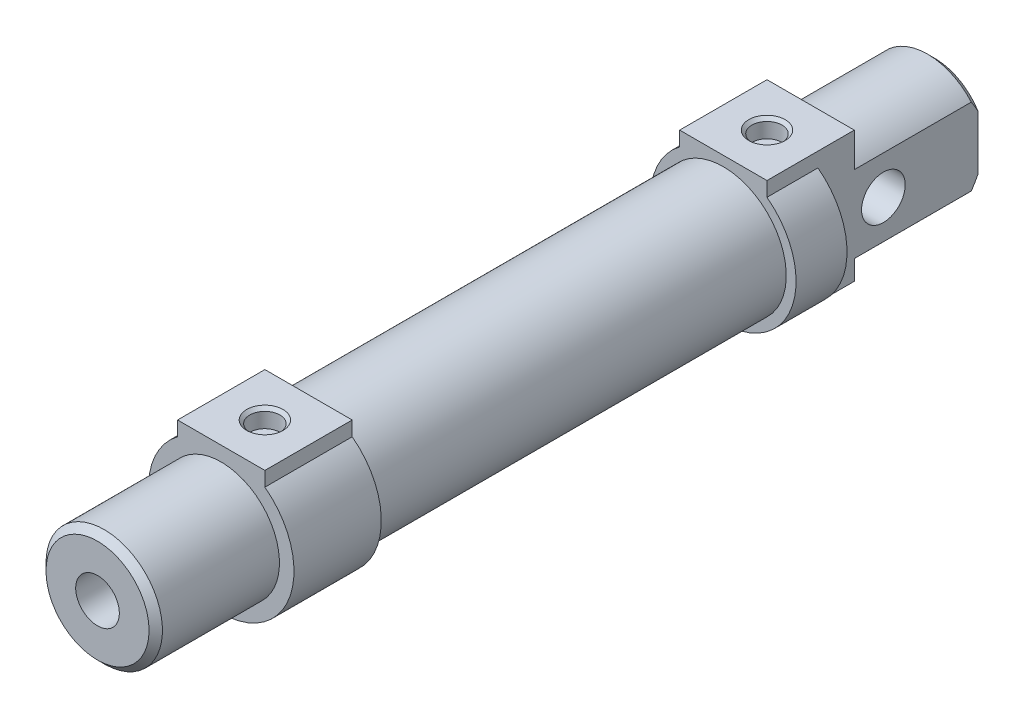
ISO-10303-21;
HEADER;
FILE_DESCRIPTION(('STEP AP214'),'2;1');
FILE_NAME('part.step','',(''),(''),'','','');
FILE_SCHEMA(('AUTOMOTIVE_DESIGN { 1 0 10303 214 1 1 1 1 }'));
ENDSEC;
DATA;
#1=APPLICATION_CONTEXT('core data for automotive mechanical design processes');
#2=APPLICATION_PROTOCOL_DEFINITION('international standard','automotive_design',2000,#1);
#3=PRODUCT_CONTEXT('',#1,'mechanical');
#4=PRODUCT('Part','Part','',(#3));
#5=PRODUCT_RELATED_PRODUCT_CATEGORY('part','',(#4));
#6=PRODUCT_DEFINITION_FORMATION('','',#4);
#7=PRODUCT_DEFINITION_CONTEXT('part definition',#1,'design');
#8=PRODUCT_DEFINITION('design','',#6,#7);
#9=PRODUCT_DEFINITION_SHAPE('','',#8);
#10=(LENGTH_UNIT() NAMED_UNIT(*) SI_UNIT(.MILLI.,.METRE.));
#11=(NAMED_UNIT(*) PLANE_ANGLE_UNIT() SI_UNIT($,.RADIAN.));
#12=(NAMED_UNIT(*) SI_UNIT($,.STERADIAN.) SOLID_ANGLE_UNIT());
#13=UNCERTAINTY_MEASURE_WITH_UNIT(LENGTH_MEASURE(1.E-05),#10,'distance_accuracy_value','');
#14=(GEOMETRIC_REPRESENTATION_CONTEXT(3) GLOBAL_UNCERTAINTY_ASSIGNED_CONTEXT((#13)) GLOBAL_UNIT_ASSIGNED_CONTEXT((#10,
#11,#12)) REPRESENTATION_CONTEXT('',''));
#15=CARTESIAN_POINT('',(0.,0.,0.));
#16=DIRECTION('',(0.,0.,1.));
#17=DIRECTION('',(1.,0.,0.));
#18=AXIS2_PLACEMENT_3D('',#15,#16,#17);
#19=CARTESIAN_POINT('',(6.,20.,-99.));
#20=DIRECTION('',(1.,0.,0.));
#21=DIRECTION('',(0.,0.,-1.));
#22=AXIS2_PLACEMENT_3D('',#19,#20,#21);
#23=PLANE('',#22);
#24=DIRECTION('',(0.,0.,-1.));
#25=VECTOR('',#24,1.);
#26=CARTESIAN_POINT('',(6.,5.29150262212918,-98.));
#27=LINE('',#26,#25);
#28=CARTESIAN_POINT('',(6.,5.29150262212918,-81.));
#29=VERTEX_POINT('',#28);
#30=CARTESIAN_POINT('',(6.,5.29150262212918,-97.08));
#31=VERTEX_POINT('',#30);
#32=EDGE_CURVE('E216',#29,#31,#27,.T.);
#33=ORIENTED_EDGE('',*,*,#32,.F.);
#34=DIRECTION('',(0.,-1.,0.));
#35=VECTOR('',#34,1.);
#36=CARTESIAN_POINT('',(6.,10.,-81.));
#37=LINE('',#36,#35);
#38=CARTESIAN_POINT('',(6.,10.,-81.));
#39=VERTEX_POINT('',#38);
#40=EDGE_CURVE('E309',#39,#29,#37,.T.);
#41=ORIENTED_EDGE('',*,*,#40,.F.);
#42=DIRECTION('',(0.,0.,-1.));
#43=VECTOR('',#42,1.);
#44=CARTESIAN_POINT('',(6.,10.,-69.));
#45=LINE('',#44,#43);
#46=CARTESIAN_POINT('',(6.,10.,-69.));
#47=VERTEX_POINT('',#46);
#48=EDGE_CURVE('E159',#47,#39,#45,.T.);
#49=ORIENTED_EDGE('',*,*,#48,.F.);
#50=DIRECTION('',(0.,-1.,0.));
#51=VECTOR('',#50,1.);
#52=CARTESIAN_POINT('',(6.,10.,-69.));
#53=LINE('',#52,#51);
#54=CARTESIAN_POINT('',(6.,8.,-69.));
#55=VERTEX_POINT('',#54);
#56=EDGE_CURVE('E155',#47,#55,#53,.T.);
#57=ORIENTED_EDGE('',*,*,#56,.T.);
#58=DIRECTION('',(0.,0.,-1.));
#59=VECTOR('',#58,1.);
#60=CARTESIAN_POINT('',(6.,8.,-98.));
#61=LINE('',#60,#59);
#62=CARTESIAN_POINT('',(6.,8.,-76.));
#63=VERTEX_POINT('',#62);
#64=EDGE_CURVE('E174',#63,#55,#61,.F.);
#65=ORIENTED_EDGE('',*,*,#64,.F.);
#66=DIRECTION('',(0.,-1.,0.));
#67=VECTOR('',#66,1.);
#68=CARTESIAN_POINT('',(6.,20.,-76.));
#69=LINE('',#68,#67);
#70=CARTESIAN_POINT('',(6.,-8.,-76.));
#71=VERTEX_POINT('',#70);
#72=EDGE_CURVE('E205',#63,#71,#69,.T.);
#73=ORIENTED_EDGE('',*,*,#72,.T.);
#74=DIRECTION('',(0.,0.,-1.));
#75=VECTOR('',#74,1.);
#76=CARTESIAN_POINT('',(6.,-8.,-98.));
#77=LINE('',#76,#75);
#78=CARTESIAN_POINT('',(6.,-8.,-81.));
#79=VERTEX_POINT('',#78);
#80=EDGE_CURVE('E241',#79,#71,#77,.F.);
#81=ORIENTED_EDGE('',*,*,#80,.F.);
#82=CARTESIAN_POINT('',(6.,-5.29150262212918,-81.));
#83=VERTEX_POINT('',#82);
#84=EDGE_CURVE('E490',#83,#79,#37,.T.);
#85=ORIENTED_EDGE('',*,*,#84,.F.);
#86=DIRECTION('',(0.,0.,-1.));
#87=VECTOR('',#86,1.);
#88=CARTESIAN_POINT('',(6.,-5.29150262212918,-98.));
#89=LINE('',#88,#87);
#90=CARTESIAN_POINT('',(6.,-5.29150262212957,-97.0799999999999));
#91=VERTEX_POINT('',#90);
#92=EDGE_CURVE('E492',#91,#83,#89,.F.);
#93=ORIENTED_EDGE('',*,*,#92,.F.);
#94=CARTESIAN_POINT('',(6.,16.5627733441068,-87.4639430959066));
#95=CARTESIAN_POINT('',(6.,16.3020845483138,-87.7090401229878));
#96=CARTESIAN_POINT('',(6.,16.0410657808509,-87.9537864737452));
#97=CARTESIAN_POINT('',(6.,15.5182599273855,-88.4424601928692));
#98=CARTESIAN_POINT('',(6.,15.256472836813,-88.6863875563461));
#99=CARTESIAN_POINT('',(6.,14.4694280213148,-89.4171067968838));
#100=CARTESIAN_POINT('',(6.,13.9428574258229,-89.9024866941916));
#101=CARTESIAN_POINT('',(6.,12.8714104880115,-90.8805679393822));
#102=CARTESIAN_POINT('',(6.,12.3264119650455,-91.373135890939));
#103=CARTESIAN_POINT('',(6.,11.503894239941,-92.1060159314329));
#104=CARTESIAN_POINT('',(6.,11.2289703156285,-92.3492400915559));
#105=CARTESIAN_POINT('',(6.,10.6770360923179,-92.8333077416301));
#106=CARTESIAN_POINT('',(6.,10.4000258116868,-93.074151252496));
#107=CARTESIAN_POINT('',(6.,9.84363689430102,-93.5527682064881));
#108=CARTESIAN_POINT('',(6.,9.56425969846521,-93.7905433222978));
#109=CARTESIAN_POINT('',(6.,9.00240208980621,-94.2624231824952));
#110=CARTESIAN_POINT('',(6.,8.71992158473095,-94.4965278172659));
#111=CARTESIAN_POINT('',(6.,8.15054557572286,-94.9605095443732));
#112=CARTESIAN_POINT('',(6.,7.86364227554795,-95.1903770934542));
#113=CARTESIAN_POINT('',(6.,7.28501814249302,-95.6439427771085));
#114=CARTESIAN_POINT('',(6.,6.99329772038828,-95.8676414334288));
#115=CARTESIAN_POINT('',(6.,6.40681903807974,-96.304498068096));
#116=CARTESIAN_POINT('',(6.,6.11212531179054,-96.5177423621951));
#117=CARTESIAN_POINT('',(6.,5.51489178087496,-96.9333520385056));
#118=CARTESIAN_POINT('',(6.,5.21234880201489,-97.1357129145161));
#119=CARTESIAN_POINT('',(6.,4.75166528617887,-97.4272648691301));
#120=CARTESIAN_POINT('',(6.,4.59722348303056,-97.5223015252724));
#121=CARTESIAN_POINT('',(6.,4.28557909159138,-97.7077225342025));
#122=CARTESIAN_POINT('',(6.,4.12837677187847,-97.7981073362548));
#123=CARTESIAN_POINT('',(6.,3.81100877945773,-97.973222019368));
#124=CARTESIAN_POINT('',(6.,3.65084561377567,-98.057956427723));
#125=CARTESIAN_POINT('',(6.,3.32714418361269,-98.2206768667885));
#126=CARTESIAN_POINT('',(6.,3.16360670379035,-98.2986644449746));
#127=CARTESIAN_POINT('',(6.,2.90691036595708,-98.4134071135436));
#128=CARTESIAN_POINT('',(6.,2.81501423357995,-98.4529933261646));
#129=CARTESIAN_POINT('',(6.,2.6300832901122,-98.5294087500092));
#130=CARTESIAN_POINT('',(6.,2.53704846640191,-98.5662379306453));
#131=CARTESIAN_POINT('',(6.,2.25617639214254,-98.672172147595));
#132=CARTESIAN_POINT('',(6.,2.06658076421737,-98.7367196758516));
#133=CARTESIAN_POINT('',(6.,1.68405321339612,-98.8508003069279));
#134=CARTESIAN_POINT('',(6.,1.49114642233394,-98.9004167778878));
#135=CARTESIAN_POINT('',(6.,1.1017046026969,-98.9826586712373));
#136=CARTESIAN_POINT('',(6.,0.905169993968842,-99.0152860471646));
#137=CARTESIAN_POINT('',(6.,0.50716361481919,-99.0618881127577));
#138=CARTESIAN_POINT('',(6.,0.305661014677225,-99.0756048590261));
#139=CARTESIAN_POINT('',(6.,-0.0976866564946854,-99.0825930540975));
#140=CARTESIAN_POINT('',(6.,-0.299531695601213,-99.0758663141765));
#141=CARTESIAN_POINT('',(6.,-0.702225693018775,-99.0423930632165));
#142=CARTESIAN_POINT('',(6.,-0.903068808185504,-99.0155775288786));
#143=CARTESIAN_POINT('',(6.,-1.30143340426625,-98.9436097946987));
#144=CARTESIAN_POINT('',(6.,-1.49895387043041,-98.8984520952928));
#145=CARTESIAN_POINT('',(6.,-1.96003700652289,-98.7731525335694));
#146=CARTESIAN_POINT('',(6.,-2.2217542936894,-98.6862681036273));
#147=CARTESIAN_POINT('',(6.,-2.73645532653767,-98.4897478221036));
#148=CARTESIAN_POINT('',(6.,-2.98943402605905,-98.3800990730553));
#149=CARTESIAN_POINT('',(6.,-3.36410352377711,-98.2021385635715));
#150=CARTESIAN_POINT('',(6.,-3.48888235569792,-98.1401827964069));
#151=CARTESIAN_POINT('',(6.,-3.73648309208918,-98.0124653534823));
#152=CARTESIAN_POINT('',(6.,-3.85930497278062,-97.9467036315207));
#153=CARTESIAN_POINT('',(6.,-4.10307983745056,-97.8119224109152));
#154=CARTESIAN_POINT('',(6.,-4.22403351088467,-97.7429041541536));
#155=CARTESIAN_POINT('',(6.,-4.46425884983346,-97.6020216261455));
#156=CARTESIAN_POINT('',(6.,-4.58353060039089,-97.5301574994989));
#157=CARTESIAN_POINT('',(6.,-4.9940209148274,-97.2769716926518));
#158=CARTESIAN_POINT('',(6.,-5.28139093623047,-97.0893983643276));
#159=CARTESIAN_POINT('',(6.,-5.84884630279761,-96.7034949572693));
#160=CARTESIAN_POINT('',(6.,-6.1289294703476,-96.5051617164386));
#161=CARTESIAN_POINT('',(6.,-6.68355530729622,-96.1003583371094));
#162=CARTESIAN_POINT('',(6.,-6.95809222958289,-95.8938803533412));
#163=CARTESIAN_POINT('',(6.,-7.50249205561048,-95.4749382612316));
#164=CARTESIAN_POINT('',(6.,-7.77235546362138,-95.2624748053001));
#165=CARTESIAN_POINT('',(6.,-8.30946665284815,-94.8320074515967));
#166=CARTESIAN_POINT('',(6.,-8.57669884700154,-94.6139841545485));
#167=CARTESIAN_POINT('',(6.,-9.10811227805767,-94.174246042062));
#168=CARTESIAN_POINT('',(6.,-9.37229344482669,-93.95253114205));
#169=CARTESIAN_POINT('',(6.,-9.89799964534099,-93.5062751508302));
#170=CARTESIAN_POINT('',(6.,-10.1595260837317,-93.2817357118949));
#171=CARTESIAN_POINT('',(6.,-10.6805000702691,-92.8302562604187));
#172=CARTESIAN_POINT('',(6.,-10.9399475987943,-92.6033162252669));
#173=CARTESIAN_POINT('',(6.,-11.655065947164,-91.9729830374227));
#174=CARTESIAN_POINT('',(6.,-12.1089016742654,-91.5675084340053));
#175=CARTESIAN_POINT('',(6.,-13.0126144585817,-90.752043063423));
#176=CARTESIAN_POINT('',(6.,-13.4624908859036,-90.3420516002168));
#177=CARTESIAN_POINT('',(6.,-14.3554721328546,-89.522089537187));
#178=CARTESIAN_POINT('',(6.,-14.7986022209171,-89.1121464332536));
#179=CARTESIAN_POINT('',(6.,-15.4614676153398,-88.4953544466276));
#180=CARTESIAN_POINT('',(6.,-15.6820965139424,-88.2894642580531));
#181=CARTESIAN_POINT('',(6.,-16.1228200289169,-87.8771140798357));
#182=CARTESIAN_POINT('',(6.,-16.3429146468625,-87.670654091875));
#183=CARTESIAN_POINT('',(6.,-16.5627733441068,-87.4639430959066));
#184=B_SPLINE_CURVE_WITH_KNOTS('',3,(#94,#95,#96,#97,#98,#99,#100,#101,#102,#103,#104,#105,#106,
#107,#108,#109,#110,#111,#112,#113,#114,#115,#116,#117,#118,#119,#120,#121,#122,#123,#124,#125,
#126,#127,#128,#129,#130,#131,#132,#133,#134,#135,#136,#137,#138,#139,#140,#141,#142,#143,#144,
#145,#146,#147,#148,#149,#150,#151,#152,#153,#154,#155,#156,#157,#158,#159,#160,#161,#162,#163,
#164,#165,#166,#167,#168,#169,#170,#171,#172,#173,#174,#175,#176,#177,#178,#179,#180,#181,#182,
#183),.UNSPECIFIED.,.F.,.F.,(4,2,2,2,2,2,2,2,2,2,2,2,2,2,2,2,2,2,2,2,2,2,2,2,2,2,2,2,2,2,2,2,2,
2,2,2,2,2,2,2,2,2,2,2,4),(0.,1.07344323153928,2.14689286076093,4.29531970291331,
6.49907904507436,7.6002817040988,8.70147468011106,9.80203958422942,10.9026372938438,
12.005468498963,13.1082061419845,14.1993080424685,15.2908582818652,15.8348155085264,
16.3787201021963,16.9221835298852,17.4655219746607,17.7656610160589,18.0658033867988,
18.6661184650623,19.2630166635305,19.8598462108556,20.4647386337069,21.0695774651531,
21.6765040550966,22.283612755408,23.1094551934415,23.9357668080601,24.3536558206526,
24.7715499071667,25.1892858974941,25.6070006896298,26.636117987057,27.6655393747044,
28.6959777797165,29.7263042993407,30.7609245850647,31.7955686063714,32.8296332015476,
33.8637075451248,35.6894187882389,37.5154154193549,39.3264118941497,40.2317348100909,
41.1370550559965),.UNSPECIFIED.);
#185=CARTESIAN_POINT('',(6.,-3.7585103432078,-98.));
#186=VERTEX_POINT('',#185);
#187=EDGE_CURVE('E56',#186,#91,#184,.T.);
#188=ORIENTED_EDGE('',*,*,#187,.F.);
#189=DIRECTION('',(0.,-1.,0.));
#190=VECTOR('',#189,1.);
#191=CARTESIAN_POINT('',(6.,7.08,-98.));
#192=LINE('',#191,#190);
#193=CARTESIAN_POINT('',(6.,3.7585103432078,-98.));
#194=VERTEX_POINT('',#193);
#195=EDGE_CURVE('E292',#194,#186,#192,.T.);
#196=ORIENTED_EDGE('',*,*,#195,.F.);
#197=EDGE_CURVE('E215',#31,#194,#184,.T.);
#198=ORIENTED_EDGE('',*,*,#197,.F.);
#199=EDGE_LOOP('',(#33,#41,#49,#57,#65,#73,#81,#85,#93,#188,#196,#198));
#200=FACE_BOUND('',#199,.T.);
#201=CARTESIAN_POINT('',(6.,0.,-85.));
#202=DIRECTION('',(1.,0.,0.));
#203=DIRECTION('',(0.,0.,-1.));
#204=AXIS2_PLACEMENT_3D('',#201,#202,#203);
#205=CIRCLE('',#204,3.);
#206=CARTESIAN_POINT('',(6.,0.,-88.));
#207=VERTEX_POINT('',#206);
#208=EDGE_CURVE('E341',#207,#207,#205,.F.);
#209=ORIENTED_EDGE('',*,*,#208,.T.);
#210=EDGE_LOOP('',(#209));
#211=FACE_BOUND('',#210,.T.);
#212=ADVANCED_FACE('F32',(#200,#211),#23,.T.);
#213=CARTESIAN_POINT('',(-6.,20.,-76.));
#214=DIRECTION('',(-1.,0.,0.));
#215=DIRECTION('',(0.,0.,1.));
#216=AXIS2_PLACEMENT_3D('',#213,#214,#215);
#217=PLANE('',#216);
#218=DIRECTION('',(0.,1.,0.));
#219=VECTOR('',#218,1.);
#220=CARTESIAN_POINT('',(-6.,10.,-81.));
#221=LINE('',#220,#219);
#222=CARTESIAN_POINT('',(-6.,5.29150262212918,-81.));
#223=VERTEX_POINT('',#222);
#224=CARTESIAN_POINT('',(-6.,10.,-81.));
#225=VERTEX_POINT('',#224);
#226=EDGE_CURVE('E249',#223,#225,#221,.T.);
#227=ORIENTED_EDGE('',*,*,#226,.F.);
#228=DIRECTION('',(0.,0.,-1.));
#229=VECTOR('',#228,1.);
#230=CARTESIAN_POINT('',(-6.,5.29150262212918,-98.));
#231=LINE('',#230,#229);
#232=CARTESIAN_POINT('',(-6.,5.29150262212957,-97.0799999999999));
#233=VERTEX_POINT('',#232);
#234=EDGE_CURVE('E246',#233,#223,#231,.F.);
#235=ORIENTED_EDGE('',*,*,#234,.F.);
#236=CARTESIAN_POINT('',(-6.,-16.5627733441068,-87.4639430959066));
#237=CARTESIAN_POINT('',(-6.,-16.3020845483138,-87.7090401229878));
#238=CARTESIAN_POINT('',(-6.,-16.0410657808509,-87.9537864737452));
#239=CARTESIAN_POINT('',(-6.,-15.5182599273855,-88.4424601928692));
#240=CARTESIAN_POINT('',(-6.,-15.256472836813,-88.6863875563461));
#241=CARTESIAN_POINT('',(-6.,-14.4694280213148,-89.4171067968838));
#242=CARTESIAN_POINT('',(-6.,-13.9428574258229,-89.9024866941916));
#243=CARTESIAN_POINT('',(-6.,-12.8714104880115,-90.8805679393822));
#244=CARTESIAN_POINT('',(-6.,-12.3264119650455,-91.373135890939));
#245=CARTESIAN_POINT('',(-6.,-11.503894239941,-92.1060159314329));
#246=CARTESIAN_POINT('',(-6.,-11.2289703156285,-92.3492400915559));
#247=CARTESIAN_POINT('',(-6.,-10.6770360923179,-92.8333077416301));
#248=CARTESIAN_POINT('',(-6.,-10.4000258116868,-93.074151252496));
#249=CARTESIAN_POINT('',(-6.,-9.84363689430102,-93.5527682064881));
#250=CARTESIAN_POINT('',(-6.,-9.56425969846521,-93.7905433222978));
#251=CARTESIAN_POINT('',(-6.,-9.00240208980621,-94.2624231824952));
#252=CARTESIAN_POINT('',(-6.,-8.71992158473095,-94.4965278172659));
#253=CARTESIAN_POINT('',(-6.,-8.15054557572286,-94.9605095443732));
#254=CARTESIAN_POINT('',(-6.,-7.86364227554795,-95.1903770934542));
#255=CARTESIAN_POINT('',(-6.,-7.28501814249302,-95.6439427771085));
#256=CARTESIAN_POINT('',(-6.,-6.99329772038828,-95.8676414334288));
#257=CARTESIAN_POINT('',(-6.,-6.40681903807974,-96.304498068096));
#258=CARTESIAN_POINT('',(-6.,-6.11212531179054,-96.5177423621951));
#259=CARTESIAN_POINT('',(-6.,-5.51489178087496,-96.9333520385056));
#260=CARTESIAN_POINT('',(-6.,-5.21234880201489,-97.1357129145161));
#261=CARTESIAN_POINT('',(-6.,-4.75166528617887,-97.4272648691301));
#262=CARTESIAN_POINT('',(-6.,-4.59722348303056,-97.5223015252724));
#263=CARTESIAN_POINT('',(-6.,-4.28557909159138,-97.7077225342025));
#264=CARTESIAN_POINT('',(-6.,-4.12837677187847,-97.7981073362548));
#265=CARTESIAN_POINT('',(-6.,-3.81100877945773,-97.973222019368));
#266=CARTESIAN_POINT('',(-6.,-3.65084561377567,-98.057956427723));
#267=CARTESIAN_POINT('',(-6.,-3.32714418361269,-98.2206768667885));
#268=CARTESIAN_POINT('',(-6.,-3.16360670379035,-98.2986644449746));
#269=CARTESIAN_POINT('',(-6.,-2.90691036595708,-98.4134071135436));
#270=CARTESIAN_POINT('',(-6.,-2.81501423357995,-98.4529933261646));
#271=CARTESIAN_POINT('',(-6.,-2.6300832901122,-98.5294087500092));
#272=CARTESIAN_POINT('',(-6.,-2.53704846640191,-98.5662379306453));
#273=CARTESIAN_POINT('',(-6.,-2.25617639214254,-98.672172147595));
#274=CARTESIAN_POINT('',(-6.,-2.06658076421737,-98.7367196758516));
#275=CARTESIAN_POINT('',(-6.,-1.68405321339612,-98.8508003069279));
#276=CARTESIAN_POINT('',(-6.,-1.49114642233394,-98.9004167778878));
#277=CARTESIAN_POINT('',(-6.,-1.1017046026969,-98.9826586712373));
#278=CARTESIAN_POINT('',(-6.,-0.905169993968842,-99.0152860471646));
#279=CARTESIAN_POINT('',(-6.,-0.50716361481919,-99.0618881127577));
#280=CARTESIAN_POINT('',(-6.,-0.305661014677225,-99.0756048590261));
#281=CARTESIAN_POINT('',(-6.,0.0976866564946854,-99.0825930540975));
#282=CARTESIAN_POINT('',(-6.,0.299531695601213,-99.0758663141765));
#283=CARTESIAN_POINT('',(-6.,0.702225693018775,-99.0423930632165));
#284=CARTESIAN_POINT('',(-6.,0.903068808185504,-99.0155775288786));
#285=CARTESIAN_POINT('',(-6.,1.30143340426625,-98.9436097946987));
#286=CARTESIAN_POINT('',(-6.,1.49895387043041,-98.8984520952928));
#287=CARTESIAN_POINT('',(-6.,1.96003700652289,-98.7731525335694));
#288=CARTESIAN_POINT('',(-6.,2.2217542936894,-98.6862681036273));
#289=CARTESIAN_POINT('',(-6.,2.73645532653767,-98.4897478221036));
#290=CARTESIAN_POINT('',(-6.,2.98943402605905,-98.3800990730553));
#291=CARTESIAN_POINT('',(-6.,3.36410352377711,-98.2021385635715));
#292=CARTESIAN_POINT('',(-6.,3.48888235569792,-98.1401827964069));
#293=CARTESIAN_POINT('',(-6.,3.73648309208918,-98.0124653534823));
#294=CARTESIAN_POINT('',(-6.,3.85930497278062,-97.9467036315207));
#295=CARTESIAN_POINT('',(-6.,4.10307983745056,-97.8119224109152));
#296=CARTESIAN_POINT('',(-6.,4.22403351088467,-97.7429041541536));
#297=CARTESIAN_POINT('',(-6.,4.46425884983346,-97.6020216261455));
#298=CARTESIAN_POINT('',(-6.,4.58353060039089,-97.5301574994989));
#299=CARTESIAN_POINT('',(-6.,4.9940209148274,-97.2769716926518));
#300=CARTESIAN_POINT('',(-6.,5.28139093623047,-97.0893983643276));
#301=CARTESIAN_POINT('',(-6.,5.84884630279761,-96.7034949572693));
#302=CARTESIAN_POINT('',(-6.,6.1289294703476,-96.5051617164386));
#303=CARTESIAN_POINT('',(-6.,6.68355530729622,-96.1003583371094));
#304=CARTESIAN_POINT('',(-6.,6.95809222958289,-95.8938803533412));
#305=CARTESIAN_POINT('',(-6.,7.50249205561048,-95.4749382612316));
#306=CARTESIAN_POINT('',(-6.,7.77235546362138,-95.2624748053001));
#307=CARTESIAN_POINT('',(-6.,8.30946665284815,-94.8320074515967));
#308=CARTESIAN_POINT('',(-6.,8.57669884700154,-94.6139841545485));
#309=CARTESIAN_POINT('',(-6.,9.10811227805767,-94.174246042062));
#310=CARTESIAN_POINT('',(-6.,9.37229344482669,-93.95253114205));
#311=CARTESIAN_POINT('',(-6.,9.89799964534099,-93.5062751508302));
#312=CARTESIAN_POINT('',(-6.,10.1595260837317,-93.2817357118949));
#313=CARTESIAN_POINT('',(-6.,10.6805000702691,-92.8302562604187));
#314=CARTESIAN_POINT('',(-6.,10.9399475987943,-92.6033162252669));
#315=CARTESIAN_POINT('',(-6.,11.655065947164,-91.9729830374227));
#316=CARTESIAN_POINT('',(-6.,12.1089016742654,-91.5675084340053));
#317=CARTESIAN_POINT('',(-6.,13.0126144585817,-90.752043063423));
#318=CARTESIAN_POINT('',(-6.,13.4624908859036,-90.3420516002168));
#319=CARTESIAN_POINT('',(-6.,14.3554721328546,-89.522089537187));
#320=CARTESIAN_POINT('',(-6.,14.7986022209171,-89.1121464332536));
#321=CARTESIAN_POINT('',(-6.,15.4614676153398,-88.4953544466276));
#322=CARTESIAN_POINT('',(-6.,15.6820965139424,-88.2894642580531));
#323=CARTESIAN_POINT('',(-6.,16.1228200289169,-87.8771140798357));
#324=CARTESIAN_POINT('',(-6.,16.3429146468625,-87.670654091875));
#325=CARTESIAN_POINT('',(-6.,16.5627733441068,-87.4639430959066));
#326=B_SPLINE_CURVE_WITH_KNOTS('',3,(#236,#237,#238,#239,#240,#241,#242,#243,#244,#245,#246,
#247,#248,#249,#250,#251,#252,#253,#254,#255,#256,#257,#258,#259,#260,#261,#262,#263,#264,#265,
#266,#267,#268,#269,#270,#271,#272,#273,#274,#275,#276,#277,#278,#279,#280,#281,#282,#283,#284,
#285,#286,#287,#288,#289,#290,#291,#292,#293,#294,#295,#296,#297,#298,#299,#300,#301,#302,#303,
#304,#305,#306,#307,#308,#309,#310,#311,#312,#313,#314,#315,#316,#317,#318,#319,#320,#321,#322,
#323,#324,#325),.UNSPECIFIED.,.F.,.F.,(4,2,2,2,2,2,2,2,2,2,2,2,2,2,2,2,2,2,2,2,2,2,2,2,2,2,2,2,
2,2,2,2,2,2,2,2,2,2,2,2,2,2,2,2,4),(0.,1.07344323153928,2.14689286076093,4.29531970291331,
6.49907904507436,7.6002817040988,8.70147468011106,9.80203958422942,10.9026372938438,
12.005468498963,13.1082061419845,14.1993080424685,15.2908582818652,15.8348155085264,
16.3787201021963,16.9221835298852,17.4655219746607,17.7656610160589,18.0658033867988,
18.6661184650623,19.2630166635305,19.8598462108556,20.4647386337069,21.0695774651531,
21.6765040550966,22.283612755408,23.1094551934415,23.9357668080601,24.3536558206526,
24.7715499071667,25.1892858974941,25.6070006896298,26.636117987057,27.6655393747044,
28.6959777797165,29.7263042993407,30.7609245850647,31.7955686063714,32.8296332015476,
33.8637075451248,35.6894187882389,37.5154154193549,39.3264118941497,40.2317348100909,
41.1370550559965),.UNSPECIFIED.);
#327=CARTESIAN_POINT('',(-6.,3.7585103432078,-98.));
#328=VERTEX_POINT('',#327);
#329=EDGE_CURVE('E233',#328,#233,#326,.T.);
#330=ORIENTED_EDGE('',*,*,#329,.F.);
#331=DIRECTION('',(0.,1.,0.));
#332=VECTOR('',#331,1.);
#333=CARTESIAN_POINT('',(-6.,7.08,-98.));
#334=LINE('',#333,#332);
#335=CARTESIAN_POINT('',(-6.,-3.7585103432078,-98.));
#336=VERTEX_POINT('',#335);
#337=EDGE_CURVE('E294',#336,#328,#334,.T.);
#338=ORIENTED_EDGE('',*,*,#337,.F.);
#339=CARTESIAN_POINT('',(-6.,-5.29150262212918,-97.08));
#340=VERTEX_POINT('',#339);
#341=EDGE_CURVE('E240',#340,#336,#326,.T.);
#342=ORIENTED_EDGE('',*,*,#341,.F.);
#343=DIRECTION('',(0.,0.,-1.));
#344=VECTOR('',#343,1.);
#345=CARTESIAN_POINT('',(-6.,-5.29150262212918,-98.));
#346=LINE('',#345,#344);
#347=CARTESIAN_POINT('',(-6.,-5.29150262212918,-81.));
#348=VERTEX_POINT('',#347);
#349=EDGE_CURVE('E243',#348,#340,#346,.T.);
#350=ORIENTED_EDGE('',*,*,#349,.F.);
#351=CARTESIAN_POINT('',(-6.,-8.,-81.));
#352=VERTEX_POINT('',#351);
#353=EDGE_CURVE('E251',#352,#348,#221,.T.);
#354=ORIENTED_EDGE('',*,*,#353,.F.);
#355=DIRECTION('',(0.,0.,-1.));
#356=VECTOR('',#355,1.);
#357=CARTESIAN_POINT('',(-6.,-8.,-98.));
#358=LINE('',#357,#356);
#359=CARTESIAN_POINT('',(-6.,-8.,-76.));
#360=VERTEX_POINT('',#359);
#361=EDGE_CURVE('E252',#360,#352,#358,.T.);
#362=ORIENTED_EDGE('',*,*,#361,.F.);
#363=DIRECTION('',(0.,-1.,0.));
#364=VECTOR('',#363,1.);
#365=CARTESIAN_POINT('',(-6.,20.,-76.));
#366=LINE('',#365,#364);
#367=CARTESIAN_POINT('',(-6.,8.,-76.));
#368=VERTEX_POINT('',#367);
#369=EDGE_CURVE('E207',#368,#360,#366,.T.);
#370=ORIENTED_EDGE('',*,*,#369,.F.);
#371=DIRECTION('',(0.,0.,-1.));
#372=VECTOR('',#371,1.);
#373=CARTESIAN_POINT('',(-6.,8.,-98.));
#374=LINE('',#373,#372);
#375=CARTESIAN_POINT('',(-6.,8.,-69.));
#376=VERTEX_POINT('',#375);
#377=EDGE_CURVE('E172',#376,#368,#374,.T.);
#378=ORIENTED_EDGE('',*,*,#377,.F.);
#379=DIRECTION('',(0.,-1.,0.));
#380=VECTOR('',#379,1.);
#381=CARTESIAN_POINT('',(-6.,10.,-69.));
#382=LINE('',#381,#380);
#383=CARTESIAN_POINT('',(-6.,10.,-69.));
#384=VERTEX_POINT('',#383);
#385=EDGE_CURVE('E153',#384,#376,#382,.T.);
#386=ORIENTED_EDGE('',*,*,#385,.F.);
#387=DIRECTION('',(0.,0.,1.));
#388=VECTOR('',#387,1.);
#389=CARTESIAN_POINT('',(-6.,10.,-81.));
#390=LINE('',#389,#388);
#391=EDGE_CURVE('E160',#225,#384,#390,.T.);
#392=ORIENTED_EDGE('',*,*,#391,.F.);
#393=EDGE_LOOP('',(#227,#235,#330,#338,#342,#350,#354,#362,#370,#378,#386,#392));
#394=FACE_BOUND('',#393,.T.);
#395=CARTESIAN_POINT('',(-6.,0.,-85.));
#396=DIRECTION('',(-1.,0.,0.));
#397=DIRECTION('',(0.,0.,1.));
#398=AXIS2_PLACEMENT_3D('',#395,#396,#397);
#399=CIRCLE('',#398,3.);
#400=CARTESIAN_POINT('',(-6.,0.,-82.));
#401=VERTEX_POINT('',#400);
#402=EDGE_CURVE('E36',#401,#401,#399,.F.);
#403=ORIENTED_EDGE('',*,*,#402,.T.);
#404=EDGE_LOOP('',(#403));
#405=FACE_BOUND('',#404,.T.);
#406=ADVANCED_FACE('F169',(#394,#405),#217,.T.);
#407=CARTESIAN_POINT('',(0.,0.,17.));
#408=DIRECTION('',(0.,0.,1.));
#409=DIRECTION('',(1.,0.,0.));
#410=AXIS2_PLACEMENT_3D('',#407,#408,#409);
#411=PLANE('',#410);
#412=CARTESIAN_POINT('',(0.,0.,17.));
#413=DIRECTION('',(0.,0.,-1.));
#414=DIRECTION('',(-1.,0.,0.));
#415=AXIS2_PLACEMENT_3D('',#412,#413,#414);
#416=CIRCLE('',#415,7.08);
#417=CARTESIAN_POINT('',(-7.08,0.,17.));
#418=VERTEX_POINT('',#417);
#419=EDGE_CURVE('E289',#418,#418,#416,.T.);
#420=ORIENTED_EDGE('',*,*,#419,.F.);
#421=EDGE_LOOP('',(#420));
#422=FACE_BOUND('',#421,.T.);
#423=CARTESIAN_POINT('',(0.,0.,17.));
#424=DIRECTION('',(0.,0.,1.));
#425=DIRECTION('',(1.,0.,0.));
#426=AXIS2_PLACEMENT_3D('',#423,#424,#425);
#427=CIRCLE('',#426,3.);
#428=CARTESIAN_POINT('',(3.,0.,17.));
#429=VERTEX_POINT('',#428);
#430=EDGE_CURVE('E329',#429,#429,#427,.T.);
#431=ORIENTED_EDGE('',*,*,#430,.F.);
#432=EDGE_LOOP('',(#431));
#433=FACE_BOUND('',#432,.T.);
#434=ADVANCED_FACE('F34',(#422,#433),#411,.T.);
#435=CARTESIAN_POINT('',(0.,0.,-98.));
#436=DIRECTION('',(0.,0.,-1.));
#437=DIRECTION('',(-1.,0.,0.));
#438=AXIS2_PLACEMENT_3D('',#435,#436,#437);
#439=CYLINDRICAL_SURFACE('',#438,10.);
#440=CARTESIAN_POINT('',(0.,0.,-69.));
#441=DIRECTION('',(0.,0.,-1.));
#442=DIRECTION('',(-1.,0.,0.));
#443=AXIS2_PLACEMENT_3D('',#440,#441,#442);
#444=CIRCLE('',#443,10.);
#445=EDGE_CURVE('E270',#55,#376,#444,.T.);
#446=ORIENTED_EDGE('',*,*,#445,.T.);
#447=ORIENTED_EDGE('',*,*,#377,.T.);
#448=CARTESIAN_POINT('',(0.,0.,-76.));
#449=DIRECTION('',(0.,0.,-1.));
#450=DIRECTION('',(-1.,0.,0.));
#451=AXIS2_PLACEMENT_3D('',#448,#449,#450);
#452=CIRCLE('',#451,10.);
#453=EDGE_CURVE('E11',#368,#360,#452,.F.);
#454=ORIENTED_EDGE('',*,*,#453,.T.);
#455=ORIENTED_EDGE('',*,*,#361,.T.);
#456=CARTESIAN_POINT('',(0.,0.,-81.));
#457=DIRECTION('',(0.,0.,-1.));
#458=DIRECTION('',(-1.,0.,0.));
#459=AXIS2_PLACEMENT_3D('',#456,#457,#458);
#460=CIRCLE('',#459,10.);
#461=EDGE_CURVE('E267',#79,#352,#460,.T.);
#462=ORIENTED_EDGE('',*,*,#461,.F.);
#463=ORIENTED_EDGE('',*,*,#80,.T.);
#464=CARTESIAN_POINT('',(0.,0.,-76.));
#465=DIRECTION('',(0.,0.,-1.));
#466=DIRECTION('',(-1.,0.,0.));
#467=AXIS2_PLACEMENT_3D('',#464,#465,#466);
#468=CIRCLE('',#467,10.);
#469=EDGE_CURVE('E41',#71,#63,#468,.F.);
#470=ORIENTED_EDGE('',*,*,#469,.T.);
#471=ORIENTED_EDGE('',*,*,#64,.T.);
#472=EDGE_LOOP('',(#446,#447,#454,#455,#462,#463,#470,#471));
#473=FACE_BOUND('',#472,.T.);
#474=ADVANCED_FACE('F301',(#473),#439,.T.);
#475=CARTESIAN_POINT('',(0.,0.,-98.));
#476=DIRECTION('',(0.,0.,-1.));
#477=DIRECTION('',(-1.,0.,0.));
#478=AXIS2_PLACEMENT_3D('',#475,#476,#477);
#479=CYLINDRICAL_SURFACE('',#478,10.);
#480=CARTESIAN_POINT('',(0.,0.,0.));
#481=DIRECTION('',(0.,0.,-1.));
#482=DIRECTION('',(-1.,0.,0.));
#483=AXIS2_PLACEMENT_3D('',#480,#481,#482);
#484=CIRCLE('',#483,10.);
#485=CARTESIAN_POINT('',(6.,8.,0.));
#486=VERTEX_POINT('',#485);
#487=CARTESIAN_POINT('',(-6.,8.,0.));
#488=VERTEX_POINT('',#487);
#489=EDGE_CURVE('E280',#486,#488,#484,.T.);
#490=ORIENTED_EDGE('',*,*,#489,.T.);
#491=DIRECTION('',(0.,0.,-1.));
#492=VECTOR('',#491,1.);
#493=CARTESIAN_POINT('',(-6.,8.,-98.));
#494=LINE('',#493,#492);
#495=CARTESIAN_POINT('',(-6.,8.,-12.));
#496=VERTEX_POINT('',#495);
#497=EDGE_CURVE('E202',#488,#496,#494,.T.);
#498=ORIENTED_EDGE('',*,*,#497,.T.);
#499=CARTESIAN_POINT('',(0.,0.,-12.));
#500=DIRECTION('',(0.,0.,-1.));
#501=DIRECTION('',(-1.,0.,0.));
#502=AXIS2_PLACEMENT_3D('',#499,#500,#501);
#503=CIRCLE('',#502,10.);
#504=CARTESIAN_POINT('',(6.,8.,-12.));
#505=VERTEX_POINT('',#504);
#506=EDGE_CURVE('E278',#505,#496,#503,.T.);
#507=ORIENTED_EDGE('',*,*,#506,.F.);
#508=DIRECTION('',(0.,0.,-1.));
#509=VECTOR('',#508,1.);
#510=CARTESIAN_POINT('',(6.,8.,-98.));
#511=LINE('',#510,#509);
#512=EDGE_CURVE('E199',#505,#486,#511,.F.);
#513=ORIENTED_EDGE('',*,*,#512,.T.);
#514=EDGE_LOOP('',(#490,#498,#507,#513));
#515=FACE_BOUND('',#514,.T.);
#516=ADVANCED_FACE('F419',(#515),#479,.T.);
#517=CARTESIAN_POINT('',(0.,10.,-81.));
#518=DIRECTION('',(0.,0.,-1.));
#519=DIRECTION('',(-1.,0.,0.));
#520=AXIS2_PLACEMENT_3D('',#517,#518,#519);
#521=PLANE('',#520);
#522=ORIENTED_EDGE('',*,*,#461,.T.);
#523=ORIENTED_EDGE('',*,*,#353,.T.);
#524=CARTESIAN_POINT('',(0.,0.,-81.));
#525=DIRECTION('',(0.,0.,-1.));
#526=DIRECTION('',(-1.,0.,0.));
#527=AXIS2_PLACEMENT_3D('',#524,#525,#526);
#528=CIRCLE('',#527,8.);
#529=EDGE_CURVE('E263',#83,#348,#528,.T.);
#530=ORIENTED_EDGE('',*,*,#529,.F.);
#531=ORIENTED_EDGE('',*,*,#84,.T.);
#532=EDGE_LOOP('',(#522,#523,#530,#531));
#533=FACE_BOUND('',#532,.T.);
#534=ADVANCED_FACE('F439',(#533),#521,.T.);
#535=EDGE_CURVE('E264',#223,#29,#528,.T.);
#536=ORIENTED_EDGE('',*,*,#535,.F.);
#537=ORIENTED_EDGE('',*,*,#226,.T.);
#538=DIRECTION('',(-1.,0.,0.));
#539=VECTOR('',#538,1.);
#540=CARTESIAN_POINT('',(6.,10.,-81.));
#541=LINE('',#540,#539);
#542=EDGE_CURVE('E165',#39,#225,#541,.T.);
#543=ORIENTED_EDGE('',*,*,#542,.F.);
#544=ORIENTED_EDGE('',*,*,#40,.T.);
#545=EDGE_LOOP('',(#536,#537,#543,#544));
#546=FACE_BOUND('',#545,.T.);
#547=ADVANCED_FACE('F513',(#546),#521,.T.);
#548=CARTESIAN_POINT('',(0.,0.,-98.));
#549=DIRECTION('',(0.,0.,-1.));
#550=DIRECTION('',(-1.,0.,0.));
#551=AXIS2_PLACEMENT_3D('',#548,#549,#550);
#552=CYLINDRICAL_SURFACE('',#551,8.);
#553=CARTESIAN_POINT('',(0.,0.,-97.08));
#554=DIRECTION('',(0.,0.,-1.));
#555=DIRECTION('',(-1.,0.,0.));
#556=AXIS2_PLACEMENT_3D('',#553,#554,#555);
#557=CIRCLE('',#556,8.);
#558=EDGE_CURVE('E260',#233,#31,#557,.T.);
#559=ORIENTED_EDGE('',*,*,#558,.F.);
#560=ORIENTED_EDGE('',*,*,#234,.T.);
#561=ORIENTED_EDGE('',*,*,#535,.T.);
#562=ORIENTED_EDGE('',*,*,#32,.T.);
#563=EDGE_LOOP('',(#559,#560,#561,#562));
#564=FACE_BOUND('',#563,.T.);
#565=ADVANCED_FACE('F508',(#564),#552,.T.);
#566=ORIENTED_EDGE('',*,*,#529,.T.);
#567=ORIENTED_EDGE('',*,*,#349,.T.);
#568=EDGE_CURVE('E259',#91,#340,#557,.T.);
#569=ORIENTED_EDGE('',*,*,#568,.F.);
#570=ORIENTED_EDGE('',*,*,#92,.T.);
#571=EDGE_LOOP('',(#566,#567,#569,#570));
#572=FACE_BOUND('',#571,.T.);
#573=ADVANCED_FACE('F506',(#572),#552,.T.);
#574=CARTESIAN_POINT('',(0.,0.,-98.));
#575=DIRECTION('',(0.,0.,1.));
#576=DIRECTION('',(1.,0.,0.));
#577=AXIS2_PLACEMENT_3D('',#574,#575,#576);
#578=CONICAL_SURFACE('',#577,7.08,0.785398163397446);
#579=ORIENTED_EDGE('',*,*,#568,.T.);
#580=ORIENTED_EDGE('',*,*,#341,.T.);
#581=CARTESIAN_POINT('',(0.,0.,-98.));
#582=DIRECTION('',(0.,0.,-1.));
#583=DIRECTION('',(-1.,0.,0.));
#584=AXIS2_PLACEMENT_3D('',#581,#582,#583);
#585=CIRCLE('',#584,7.08);
#586=EDGE_CURVE('E255',#186,#336,#585,.T.);
#587=ORIENTED_EDGE('',*,*,#586,.F.);
#588=ORIENTED_EDGE('',*,*,#187,.T.);
#589=EDGE_LOOP('',(#579,#580,#587,#588));
#590=FACE_BOUND('',#589,.T.);
#591=ADVANCED_FACE('F218',(#590),#578,.T.);
#592=EDGE_CURVE('E256',#328,#194,#585,.T.);
#593=ORIENTED_EDGE('',*,*,#592,.F.);
#594=ORIENTED_EDGE('',*,*,#329,.T.);
#595=ORIENTED_EDGE('',*,*,#558,.T.);
#596=ORIENTED_EDGE('',*,*,#197,.T.);
#597=EDGE_LOOP('',(#593,#594,#595,#596));
#598=FACE_BOUND('',#597,.T.);
#599=ADVANCED_FACE('F450',(#598),#578,.T.);
#600=CARTESIAN_POINT('',(0.,7.08,-98.));
#601=DIRECTION('',(0.,0.,-1.));
#602=DIRECTION('',(-1.,0.,0.));
#603=AXIS2_PLACEMENT_3D('',#600,#601,#602);
#604=PLANE('',#603);
#605=ORIENTED_EDGE('',*,*,#586,.T.);
#606=ORIENTED_EDGE('',*,*,#337,.T.);
#607=ORIENTED_EDGE('',*,*,#592,.T.);
#608=ORIENTED_EDGE('',*,*,#195,.T.);
#609=EDGE_LOOP('',(#605,#606,#607,#608));
#610=FACE_BOUND('',#609,.T.);
#611=ADVANCED_FACE('F445',(#610),#604,.T.);
#612=CARTESIAN_POINT('',(0.,0.,16.08));
#613=DIRECTION('',(0.,0.,-1.));
#614=DIRECTION('',(-1.,0.,0.));
#615=AXIS2_PLACEMENT_3D('',#612,#613,#614);
#616=CONICAL_SURFACE('',#615,8.,0.785398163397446);
#617=ORIENTED_EDGE('',*,*,#419,.T.);
#618=EDGE_LOOP('',(#617));
#619=FACE_BOUND('',#618,.T.);
#620=CARTESIAN_POINT('',(0.,0.,16.08));
#621=DIRECTION('',(0.,0.,-1.));
#622=DIRECTION('',(-1.,0.,0.));
#623=AXIS2_PLACEMENT_3D('',#620,#621,#622);
#624=CIRCLE('',#623,8.);
#625=CARTESIAN_POINT('',(-8.,0.,16.08));
#626=VERTEX_POINT('',#625);
#627=EDGE_CURVE('E286',#626,#626,#624,.T.);
#628=ORIENTED_EDGE('',*,*,#627,.F.);
#629=EDGE_LOOP('',(#628));
#630=FACE_BOUND('',#629,.T.);
#631=ADVANCED_FACE('F442',(#619,#630),#616,.T.);
#632=CARTESIAN_POINT('',(0.,0.,-98.));
#633=DIRECTION('',(0.,0.,-1.));
#634=DIRECTION('',(-1.,0.,0.));
#635=AXIS2_PLACEMENT_3D('',#632,#633,#634);
#636=CYLINDRICAL_SURFACE('',#635,8.);
#637=ORIENTED_EDGE('',*,*,#627,.T.);
#638=EDGE_LOOP('',(#637));
#639=FACE_BOUND('',#638,.T.);
#640=CARTESIAN_POINT('',(0.,0.,0.));
#641=DIRECTION('',(0.,0.,-1.));
#642=DIRECTION('',(-1.,0.,0.));
#643=AXIS2_PLACEMENT_3D('',#640,#641,#642);
#644=CIRCLE('',#643,8.);
#645=CARTESIAN_POINT('',(-8.,0.,0.));
#646=VERTEX_POINT('',#645);
#647=EDGE_CURVE('E283',#646,#646,#644,.T.);
#648=ORIENTED_EDGE('',*,*,#647,.F.);
#649=EDGE_LOOP('',(#648));
#650=FACE_BOUND('',#649,.T.);
#651=ADVANCED_FACE('F433',(#639,#650),#636,.T.);
#652=CARTESIAN_POINT('',(0.,8.,0.));
#653=DIRECTION('',(0.,0.,1.));
#654=DIRECTION('',(1.,0.,0.));
#655=AXIS2_PLACEMENT_3D('',#652,#653,#654);
#656=PLANE('',#655);
#657=DIRECTION('',(0.,-1.,0.));
#658=VECTOR('',#657,1.);
#659=CARTESIAN_POINT('',(-6.,10.,0.));
#660=LINE('',#659,#658);
#661=CARTESIAN_POINT('',(-6.,10.,0.));
#662=VERTEX_POINT('',#661);
#663=EDGE_CURVE('E196',#662,#488,#660,.T.);
#664=ORIENTED_EDGE('',*,*,#663,.T.);
#665=ORIENTED_EDGE('',*,*,#489,.F.);
#666=DIRECTION('',(0.,-1.,0.));
#667=VECTOR('',#666,1.);
#668=CARTESIAN_POINT('',(6.,10.,0.));
#669=LINE('',#668,#667);
#670=CARTESIAN_POINT('',(6.,10.,0.));
#671=VERTEX_POINT('',#670);
#672=EDGE_CURVE('E194',#671,#486,#669,.T.);
#673=ORIENTED_EDGE('',*,*,#672,.F.);
#674=DIRECTION('',(1.,0.,0.));
#675=VECTOR('',#674,1.);
#676=CARTESIAN_POINT('',(-6.,10.,0.));
#677=LINE('',#676,#675);
#678=EDGE_CURVE('E184',#662,#671,#677,.T.);
#679=ORIENTED_EDGE('',*,*,#678,.F.);
#680=EDGE_LOOP('',(#664,#665,#673,#679));
#681=FACE_BOUND('',#680,.T.);
#682=ORIENTED_EDGE('',*,*,#647,.T.);
#683=EDGE_LOOP('',(#682));
#684=FACE_BOUND('',#683,.T.);
#685=ADVANCED_FACE('F416',(#681,#684),#656,.T.);
#686=CARTESIAN_POINT('',(0.,10.,-12.));
#687=DIRECTION('',(0.,0.,-1.));
#688=DIRECTION('',(-1.,0.,0.));
#689=AXIS2_PLACEMENT_3D('',#686,#687,#688);
#690=PLANE('',#689);
#691=CARTESIAN_POINT('',(0.,0.,-12.));
#692=DIRECTION('',(0.,0.,-1.));
#693=DIRECTION('',(-1.,0.,0.));
#694=AXIS2_PLACEMENT_3D('',#691,#692,#693);
#695=CIRCLE('',#694,8.65);
#696=CARTESIAN_POINT('',(-8.65,0.,-12.));
#697=VERTEX_POINT('',#696);
#698=EDGE_CURVE('E275',#697,#697,#695,.T.);
#699=ORIENTED_EDGE('',*,*,#698,.F.);
#700=EDGE_LOOP('',(#699));
#701=FACE_BOUND('',#700,.T.);
#702=ORIENTED_EDGE('',*,*,#506,.T.);
#703=DIRECTION('',(0.,-1.,0.));
#704=VECTOR('',#703,1.);
#705=CARTESIAN_POINT('',(-6.,10.,-12.));
#706=LINE('',#705,#704);
#707=CARTESIAN_POINT('',(-6.,10.,-12.));
#708=VERTEX_POINT('',#707);
#709=EDGE_CURVE('E191',#708,#496,#706,.T.);
#710=ORIENTED_EDGE('',*,*,#709,.F.);
#711=DIRECTION('',(-1.,0.,0.));
#712=VECTOR('',#711,1.);
#713=CARTESIAN_POINT('',(6.,10.,-12.));
#714=LINE('',#713,#712);
#715=CARTESIAN_POINT('',(6.,10.,-12.));
#716=VERTEX_POINT('',#715);
#717=EDGE_CURVE('E189',#716,#708,#714,.T.);
#718=ORIENTED_EDGE('',*,*,#717,.F.);
#719=DIRECTION('',(0.,-1.,0.));
#720=VECTOR('',#719,1.);
#721=CARTESIAN_POINT('',(6.,10.,-12.));
#722=LINE('',#721,#720);
#723=EDGE_CURVE('E48',#716,#505,#722,.T.);
#724=ORIENTED_EDGE('',*,*,#723,.T.);
#725=EDGE_LOOP('',(#702,#710,#718,#724));
#726=FACE_BOUND('',#725,.T.);
#727=ADVANCED_FACE('F422',(#701,#726),#690,.T.);
#728=CARTESIAN_POINT('',(0.,0.,-98.));
#729=DIRECTION('',(0.,0.,-1.));
#730=DIRECTION('',(-1.,0.,0.));
#731=AXIS2_PLACEMENT_3D('',#728,#729,#730);
#732=CYLINDRICAL_SURFACE('',#731,8.65);
#733=ORIENTED_EDGE('',*,*,#698,.T.);
#734=EDGE_LOOP('',(#733));
#735=FACE_BOUND('',#734,.T.);
#736=CARTESIAN_POINT('',(0.,0.,-69.));
#737=DIRECTION('',(0.,0.,-1.));
#738=DIRECTION('',(-1.,0.,0.));
#739=AXIS2_PLACEMENT_3D('',#736,#737,#738);
#740=CIRCLE('',#739,8.65);
#741=CARTESIAN_POINT('',(-8.65,0.,-69.));
#742=VERTEX_POINT('',#741);
#743=EDGE_CURVE('E272',#742,#742,#740,.T.);
#744=ORIENTED_EDGE('',*,*,#743,.F.);
#745=EDGE_LOOP('',(#744));
#746=FACE_BOUND('',#745,.T.);
#747=ADVANCED_FACE('F424',(#735,#746),#732,.T.);
#748=CARTESIAN_POINT('',(0.,8.65,-69.));
#749=DIRECTION('',(0.,0.,1.));
#750=DIRECTION('',(1.,0.,0.));
#751=AXIS2_PLACEMENT_3D('',#748,#749,#750);
#752=PLANE('',#751);
#753=ORIENTED_EDGE('',*,*,#445,.F.);
#754=ORIENTED_EDGE('',*,*,#56,.F.);
#755=DIRECTION('',(1.,0.,0.));
#756=VECTOR('',#755,1.);
#757=CARTESIAN_POINT('',(-6.,10.,-69.));
#758=LINE('',#757,#756);
#759=EDGE_CURVE('E147',#384,#47,#758,.T.);
#760=ORIENTED_EDGE('',*,*,#759,.F.);
#761=ORIENTED_EDGE('',*,*,#385,.T.);
#762=EDGE_LOOP('',(#753,#754,#760,#761));
#763=FACE_BOUND('',#762,.T.);
#764=ORIENTED_EDGE('',*,*,#743,.T.);
#765=EDGE_LOOP('',(#764));
#766=FACE_BOUND('',#765,.T.);
#767=ADVANCED_FACE('F150',(#763,#766),#752,.T.);
#768=CARTESIAN_POINT('',(6.,20.,-76.));
#769=DIRECTION('',(0.,0.,-1.));
#770=DIRECTION('',(-1.,0.,0.));
#771=AXIS2_PLACEMENT_3D('',#768,#769,#770);
#772=PLANE('',#771);
#773=ORIENTED_EDGE('',*,*,#72,.F.);
#774=ORIENTED_EDGE('',*,*,#469,.F.);
#775=EDGE_LOOP('',(#773,#774));
#776=FACE_BOUND('',#775,.T.);
#777=ADVANCED_FACE('F226',(#776),#772,.T.);
#778=CARTESIAN_POINT('',(-26.,20.,-76.));
#779=DIRECTION('',(0.,0.,-1.));
#780=DIRECTION('',(-1.,0.,0.));
#781=AXIS2_PLACEMENT_3D('',#778,#779,#780);
#782=PLANE('',#781);
#783=ORIENTED_EDGE('',*,*,#369,.T.);
#784=ORIENTED_EDGE('',*,*,#453,.F.);
#785=EDGE_LOOP('',(#783,#784));
#786=FACE_BOUND('',#785,.T.);
#787=ADVANCED_FACE('F231',(#786),#782,.T.);
#788=CARTESIAN_POINT('',(-6.,10.,0.));
#789=DIRECTION('',(0.,1.,0.));
#790=DIRECTION('',(0.,0.,1.));
#791=AXIS2_PLACEMENT_3D('',#788,#789,#790);
#792=PLANE('',#791);
#793=CARTESIAN_POINT('',(0.,10.,-6.));
#794=DIRECTION('',(0.,-1.,0.));
#795=DIRECTION('',(0.,0.,-1.));
#796=AXIS2_PLACEMENT_3D('',#793,#794,#795);
#797=CIRCLE('',#796,2.5);
#798=CARTESIAN_POINT('',(0.,10.,-8.5));
#799=VERTEX_POINT('',#798);
#800=EDGE_CURVE('E167',#799,#799,#797,.T.);
#801=ORIENTED_EDGE('',*,*,#800,.T.);
#802=EDGE_LOOP('',(#801));
#803=FACE_BOUND('',#802,.T.);
#804=ORIENTED_EDGE('',*,*,#678,.T.);
#805=DIRECTION('',(0.,0.,-1.));
#806=VECTOR('',#805,1.);
#807=CARTESIAN_POINT('',(6.,10.,0.));
#808=LINE('',#807,#806);
#809=EDGE_CURVE('E186',#671,#716,#808,.T.);
#810=ORIENTED_EDGE('',*,*,#809,.T.);
#811=ORIENTED_EDGE('',*,*,#717,.T.);
#812=DIRECTION('',(0.,0.,1.));
#813=VECTOR('',#812,1.);
#814=CARTESIAN_POINT('',(-6.,10.,-12.));
#815=LINE('',#814,#813);
#816=EDGE_CURVE('E181',#708,#662,#815,.T.);
#817=ORIENTED_EDGE('',*,*,#816,.T.);
#818=EDGE_LOOP('',(#804,#810,#811,#817));
#819=FACE_BOUND('',#818,.T.);
#820=ADVANCED_FACE('F398',(#803,#819),#792,.T.);
#821=CARTESIAN_POINT('',(-6.,10.,-12.));
#822=DIRECTION('',(1.,0.,0.));
#823=DIRECTION('',(0.,0.,-1.));
#824=AXIS2_PLACEMENT_3D('',#821,#822,#823);
#825=PLANE('',#824);
#826=ORIENTED_EDGE('',*,*,#497,.F.);
#827=ORIENTED_EDGE('',*,*,#663,.F.);
#828=ORIENTED_EDGE('',*,*,#816,.F.);
#829=ORIENTED_EDGE('',*,*,#709,.T.);
#830=EDGE_LOOP('',(#826,#827,#828,#829));
#831=FACE_BOUND('',#830,.T.);
#832=ADVANCED_FACE('F401',(#831),#825,.F.);
#833=CARTESIAN_POINT('',(6.,10.,0.));
#834=DIRECTION('',(-1.,0.,0.));
#835=DIRECTION('',(0.,0.,1.));
#836=AXIS2_PLACEMENT_3D('',#833,#834,#835);
#837=PLANE('',#836);
#838=ORIENTED_EDGE('',*,*,#512,.F.);
#839=ORIENTED_EDGE('',*,*,#723,.F.);
#840=ORIENTED_EDGE('',*,*,#809,.F.);
#841=ORIENTED_EDGE('',*,*,#672,.T.);
#842=EDGE_LOOP('',(#838,#839,#840,#841));
#843=FACE_BOUND('',#842,.T.);
#844=ADVANCED_FACE('F396',(#843),#837,.F.);
#845=CARTESIAN_POINT('',(-6.,10.,-69.));
#846=DIRECTION('',(0.,1.,0.));
#847=DIRECTION('',(0.,0.,1.));
#848=AXIS2_PLACEMENT_3D('',#845,#846,#847);
#849=PLANE('',#848);
#850=CARTESIAN_POINT('',(0.,10.,-75.));
#851=DIRECTION('',(0.,-1.,0.));
#852=DIRECTION('',(0.,0.,-1.));
#853=AXIS2_PLACEMENT_3D('',#850,#851,#852);
#854=CIRCLE('',#853,2.5);
#855=CARTESIAN_POINT('',(0.,10.,-77.5));
#856=VERTEX_POINT('',#855);
#857=EDGE_CURVE('E320',#856,#856,#854,.T.);
#858=ORIENTED_EDGE('',*,*,#857,.T.);
#859=EDGE_LOOP('',(#858));
#860=FACE_BOUND('',#859,.T.);
#861=ORIENTED_EDGE('',*,*,#759,.T.);
#862=ORIENTED_EDGE('',*,*,#48,.T.);
#863=ORIENTED_EDGE('',*,*,#542,.T.);
#864=ORIENTED_EDGE('',*,*,#391,.T.);
#865=EDGE_LOOP('',(#861,#862,#863,#864));
#866=FACE_BOUND('',#865,.T.);
#867=ADVANCED_FACE('F164',(#860,#866),#849,.T.);
#868=CARTESIAN_POINT('',(0.,9.567,-6.));
#869=DIRECTION('',(0.,1.,0.));
#870=DIRECTION('',(0.,0.,1.));
#871=AXIS2_PLACEMENT_3D('',#868,#869,#870);
#872=CONICAL_SURFACE('',#871,2.067,0.78539816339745);
#873=ORIENTED_EDGE('',*,*,#800,.F.);
#874=EDGE_LOOP('',(#873));
#875=FACE_BOUND('',#874,.T.);
#876=CARTESIAN_POINT('',(0.,9.567,-6.));
#877=DIRECTION('',(0.,-1.,0.));
#878=DIRECTION('',(0.,0.,-1.));
#879=AXIS2_PLACEMENT_3D('',#876,#877,#878);
#880=CIRCLE('',#879,2.067);
#881=CARTESIAN_POINT('',(0.,9.567,-8.067));
#882=VERTEX_POINT('',#881);
#883=EDGE_CURVE('E314',#882,#882,#880,.T.);
#884=ORIENTED_EDGE('',*,*,#883,.T.);
#885=EDGE_LOOP('',(#884));
#886=FACE_BOUND('',#885,.T.);
#887=ADVANCED_FACE('F389',(#875,#886),#872,.F.);
#888=CARTESIAN_POINT('',(0.,7.5,-6.));
#889=DIRECTION('',(0.,-1.,0.));
#890=DIRECTION('',(0.,0.,-1.));
#891=AXIS2_PLACEMENT_3D('',#888,#889,#890);
#892=CYLINDRICAL_SURFACE('',#891,2.067);
#893=ORIENTED_EDGE('',*,*,#883,.F.);
#894=EDGE_LOOP('',(#893));
#895=FACE_BOUND('',#894,.T.);
#896=CARTESIAN_POINT('',(0.,7.5,-6.));
#897=DIRECTION('',(0.,-1.,0.));
#898=DIRECTION('',(0.,0.,-1.));
#899=AXIS2_PLACEMENT_3D('',#896,#897,#898);
#900=CIRCLE('',#899,2.067);
#901=CARTESIAN_POINT('',(0.,7.5,-8.067));
#902=VERTEX_POINT('',#901);
#903=EDGE_CURVE('E317',#902,#902,#900,.T.);
#904=ORIENTED_EDGE('',*,*,#903,.T.);
#905=EDGE_LOOP('',(#904));
#906=FACE_BOUND('',#905,.T.);
#907=ADVANCED_FACE('F385',(#895,#906),#892,.F.);
#908=CARTESIAN_POINT('',(0.,7.5,-8.067));
#909=DIRECTION('',(0.,-1.,0.));
#910=DIRECTION('',(0.,0.,-1.));
#911=AXIS2_PLACEMENT_3D('',#908,#909,#910);
#912=PLANE('',#911);
#913=ORIENTED_EDGE('',*,*,#903,.F.);
#914=EDGE_LOOP('',(#913));
#915=FACE_BOUND('',#914,.T.);
#916=ADVANCED_FACE('F381',(#915),#912,.F.);
#917=CARTESIAN_POINT('',(0.,9.567,-75.));
#918=DIRECTION('',(0.,1.,0.));
#919=DIRECTION('',(0.,0.,1.));
#920=AXIS2_PLACEMENT_3D('',#917,#918,#919);
#921=CONICAL_SURFACE('',#920,2.067,0.785398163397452);
#922=ORIENTED_EDGE('',*,*,#857,.F.);
#923=EDGE_LOOP('',(#922));
#924=FACE_BOUND('',#923,.T.);
#925=CARTESIAN_POINT('',(0.,9.567,-75.));
#926=DIRECTION('',(0.,-1.,0.));
#927=DIRECTION('',(0.,0.,-1.));
#928=AXIS2_PLACEMENT_3D('',#925,#926,#927);
#929=CIRCLE('',#928,2.067);
#930=CARTESIAN_POINT('',(0.,9.567,-77.067));
#931=VERTEX_POINT('',#930);
#932=EDGE_CURVE('E323',#931,#931,#929,.T.);
#933=ORIENTED_EDGE('',*,*,#932,.T.);
#934=EDGE_LOOP('',(#933));
#935=FACE_BOUND('',#934,.T.);
#936=ADVANCED_FACE('F377',(#924,#935),#921,.F.);
#937=CARTESIAN_POINT('',(0.,7.5,-75.));
#938=DIRECTION('',(0.,-1.,0.));
#939=DIRECTION('',(0.,0.,-1.));
#940=AXIS2_PLACEMENT_3D('',#937,#938,#939);
#941=CYLINDRICAL_SURFACE('',#940,2.067);
#942=ORIENTED_EDGE('',*,*,#932,.F.);
#943=EDGE_LOOP('',(#942));
#944=FACE_BOUND('',#943,.T.);
#945=CARTESIAN_POINT('',(0.,7.5,-75.));
#946=DIRECTION('',(0.,-1.,0.));
#947=DIRECTION('',(0.,0.,-1.));
#948=AXIS2_PLACEMENT_3D('',#945,#946,#947);
#949=CIRCLE('',#948,2.067);
#950=CARTESIAN_POINT('',(0.,7.5,-77.067));
#951=VERTEX_POINT('',#950);
#952=EDGE_CURVE('E326',#951,#951,#949,.T.);
#953=ORIENTED_EDGE('',*,*,#952,.T.);
#954=EDGE_LOOP('',(#953));
#955=FACE_BOUND('',#954,.T.);
#956=ADVANCED_FACE('F373',(#944,#955),#941,.F.);
#957=CARTESIAN_POINT('',(0.,7.5,-77.067));
#958=DIRECTION('',(0.,-1.,0.));
#959=DIRECTION('',(0.,0.,-1.));
#960=AXIS2_PLACEMENT_3D('',#957,#958,#959);
#961=PLANE('',#960);
#962=ORIENTED_EDGE('',*,*,#952,.F.);
#963=EDGE_LOOP('',(#962));
#964=FACE_BOUND('',#963,.T.);
#965=ADVANCED_FACE('F369',(#964),#961,.F.);
#966=CARTESIAN_POINT('',(0.,0.,-64.));
#967=DIRECTION('',(0.,0.,1.));
#968=DIRECTION('',(1.,0.,0.));
#969=AXIS2_PLACEMENT_3D('',#966,#967,#968);
#970=CYLINDRICAL_SURFACE('',#969,3.);
#971=ORIENTED_EDGE('',*,*,#430,.T.);
#972=EDGE_LOOP('',(#971));
#973=FACE_BOUND('',#972,.T.);
#974=CARTESIAN_POINT('',(0.,0.,-35.));
#975=DIRECTION('',(0.,0.,1.));
#976=DIRECTION('',(1.,0.,0.));
#977=AXIS2_PLACEMENT_3D('',#974,#975,#976);
#978=CIRCLE('',#977,3.);
#979=CARTESIAN_POINT('',(3.,0.,-35.));
#980=VERTEX_POINT('',#979);
#981=EDGE_CURVE('E332',#980,#980,#978,.T.);
#982=ORIENTED_EDGE('',*,*,#981,.F.);
#983=EDGE_LOOP('',(#982));
#984=FACE_BOUND('',#983,.T.);
#985=ADVANCED_FACE('F365',(#973,#984),#970,.F.);
#986=CARTESIAN_POINT('',(0.,3.,-35.));
#987=DIRECTION('',(0.,0.,-1.));
#988=DIRECTION('',(-1.,0.,0.));
#989=AXIS2_PLACEMENT_3D('',#986,#987,#988);
#990=PLANE('',#989);
#991=ORIENTED_EDGE('',*,*,#981,.T.);
#992=EDGE_LOOP('',(#991));
#993=FACE_BOUND('',#992,.T.);
#994=CARTESIAN_POINT('',(0.,0.,-35.));
#995=DIRECTION('',(0.,0.,1.));
#996=DIRECTION('',(1.,0.,0.));
#997=AXIS2_PLACEMENT_3D('',#994,#995,#996);
#998=CIRCLE('',#997,8.);
#999=CARTESIAN_POINT('',(8.,0.,-35.));
#1000=VERTEX_POINT('',#999);
#1001=EDGE_CURVE('E335',#1000,#1000,#998,.T.);
#1002=ORIENTED_EDGE('',*,*,#1001,.F.);
#1003=EDGE_LOOP('',(#1002));
#1004=FACE_BOUND('',#1003,.T.);
#1005=ADVANCED_FACE('F361',(#993,#1004),#990,.T.);
#1006=CARTESIAN_POINT('',(0.,0.,-64.));
#1007=DIRECTION('',(0.,0.,1.));
#1008=DIRECTION('',(1.,0.,0.));
#1009=AXIS2_PLACEMENT_3D('',#1006,#1007,#1008);
#1010=CYLINDRICAL_SURFACE('',#1009,8.);
#1011=ORIENTED_EDGE('',*,*,#1001,.T.);
#1012=EDGE_LOOP('',(#1011));
#1013=FACE_BOUND('',#1012,.T.);
#1014=CARTESIAN_POINT('',(0.,0.,-64.));
#1015=DIRECTION('',(0.,0.,1.));
#1016=DIRECTION('',(1.,0.,0.));
#1017=AXIS2_PLACEMENT_3D('',#1014,#1015,#1016);
#1018=CIRCLE('',#1017,8.);
#1019=CARTESIAN_POINT('',(8.,0.,-64.));
#1020=VERTEX_POINT('',#1019);
#1021=EDGE_CURVE('E338',#1020,#1020,#1018,.T.);
#1022=ORIENTED_EDGE('',*,*,#1021,.F.);
#1023=EDGE_LOOP('',(#1022));
#1024=FACE_BOUND('',#1023,.T.);
#1025=ADVANCED_FACE('F355',(#1013,#1024),#1010,.F.);
#1026=CARTESIAN_POINT('',(0.,8.,-64.));
#1027=DIRECTION('',(0.,0.,1.));
#1028=DIRECTION('',(1.,0.,0.));
#1029=AXIS2_PLACEMENT_3D('',#1026,#1027,#1028);
#1030=PLANE('',#1029);
#1031=ORIENTED_EDGE('',*,*,#1021,.T.);
#1032=EDGE_LOOP('',(#1031));
#1033=FACE_BOUND('',#1032,.T.);
#1034=ADVANCED_FACE('F349',(#1033),#1030,.T.);
#1035=CARTESIAN_POINT('',(20.,0.,-85.));
#1036=DIRECTION('',(-1.,0.,0.));
#1037=DIRECTION('',(0.,0.,1.));
#1038=AXIS2_PLACEMENT_3D('',#1035,#1036,#1037);
#1039=CYLINDRICAL_SURFACE('',#1038,3.);
#1040=ORIENTED_EDGE('',*,*,#208,.F.);
#1041=EDGE_LOOP('',(#1040));
#1042=FACE_BOUND('',#1041,.T.);
#1043=ORIENTED_EDGE('',*,*,#402,.F.);
#1044=EDGE_LOOP('',(#1043));
#1045=FACE_BOUND('',#1044,.T.);
#1046=ADVANCED_FACE('F347',(#1042,#1045),#1039,.F.);
#1047=CLOSED_SHELL('',(#212,#406,#434,#474,#516,#534,#547,#565,#573,#591,#599,#611,#631,#651,
#685,#727,#747,#767,#777,#787,#820,#832,#844,#867,#887,#907,#916,#936,#956,#965,#985,#1005,
#1025,#1034,#1046));
#1048=MANIFOLD_SOLID_BREP('B2',#1047);
#1049=ADVANCED_BREP_SHAPE_REPRESENTATION('',(#18,#1048),#14);
#1050=SHAPE_DEFINITION_REPRESENTATION(#9,#1049);
ENDSEC;
END-ISO-10303-21;
